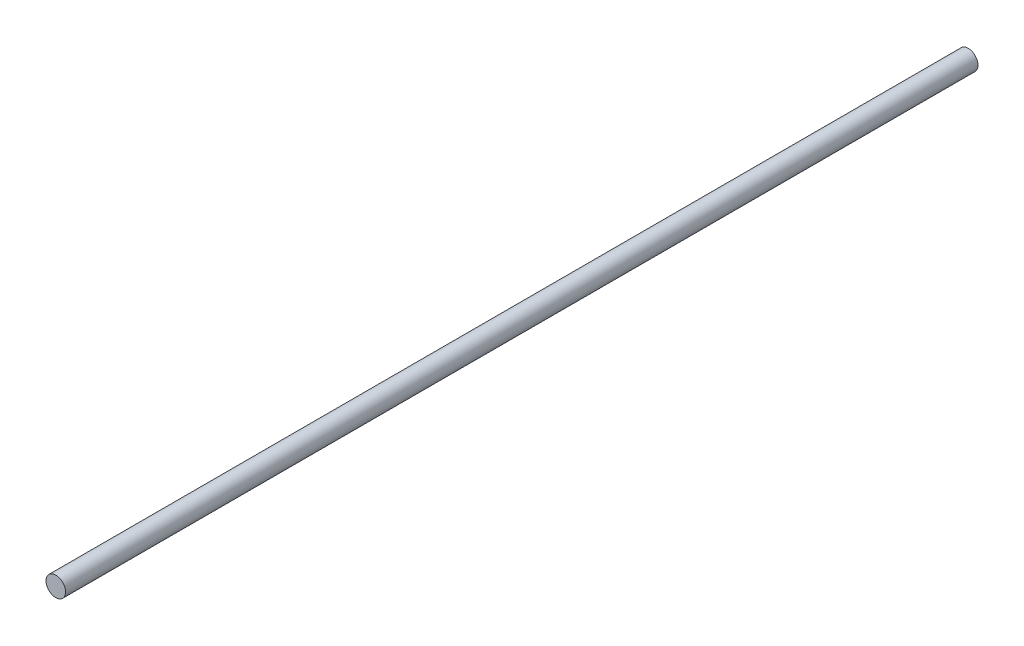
from build123d import *

# Parameters (mm, degrees)
SKETCH1_R           = 30
BOSS_EXTRUDE1_DEPTH = 2800


with BuildPart() as part:
    # Sketch1 → Boss-Extrude1 (new body)
    with BuildSketch(Plane.XY):
        Circle(SKETCH1_R)
    extrude(amount=-BOSS_EXTRUDE1_DEPTH)


solid = part.part
